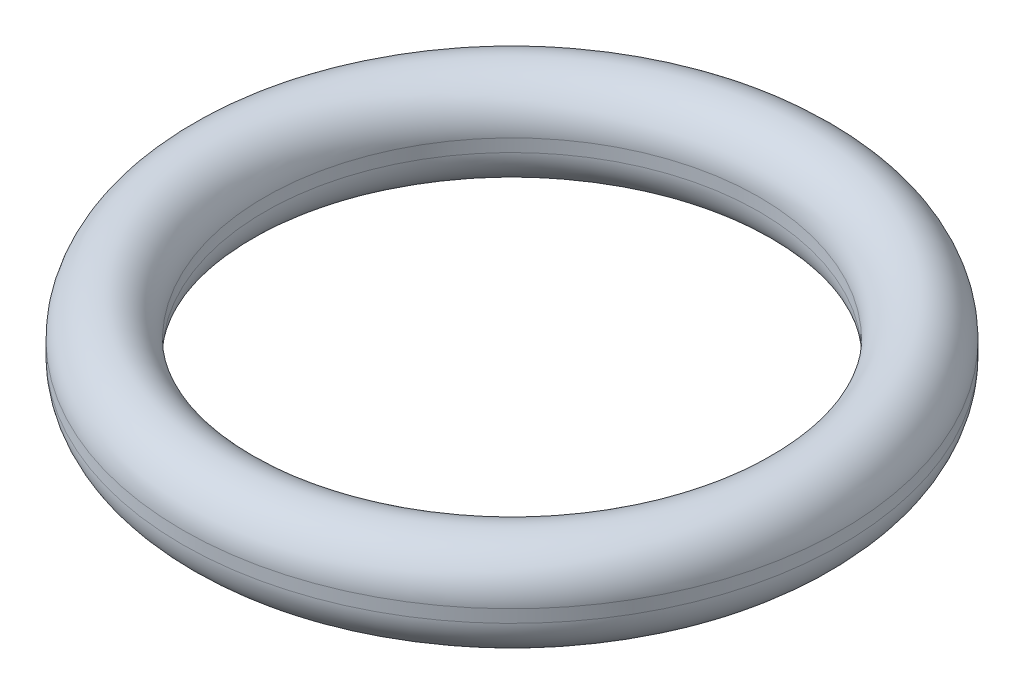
ISO-10303-21;
HEADER;
FILE_DESCRIPTION(('STEP AP214'),'2;1');
FILE_NAME('part.step','',(''),(''),'','','');
FILE_SCHEMA(('AUTOMOTIVE_DESIGN { 1 0 10303 214 1 1 1 1 }'));
ENDSEC;
DATA;
#1=APPLICATION_CONTEXT('core data for automotive mechanical design processes');
#2=APPLICATION_PROTOCOL_DEFINITION('international standard','automotive_design',2000,#1);
#3=PRODUCT_CONTEXT('',#1,'mechanical');
#4=PRODUCT('Part','Part','',(#3));
#5=PRODUCT_RELATED_PRODUCT_CATEGORY('part','',(#4));
#6=PRODUCT_DEFINITION_FORMATION('','',#4);
#7=PRODUCT_DEFINITION_CONTEXT('part definition',#1,'design');
#8=PRODUCT_DEFINITION('design','',#6,#7);
#9=PRODUCT_DEFINITION_SHAPE('','',#8);
#10=(LENGTH_UNIT() NAMED_UNIT(*) SI_UNIT(.MILLI.,.METRE.));
#11=(NAMED_UNIT(*) PLANE_ANGLE_UNIT() SI_UNIT($,.RADIAN.));
#12=(NAMED_UNIT(*) SI_UNIT($,.STERADIAN.) SOLID_ANGLE_UNIT());
#13=UNCERTAINTY_MEASURE_WITH_UNIT(LENGTH_MEASURE(1.E-05),#10,'distance_accuracy_value','');
#14=(GEOMETRIC_REPRESENTATION_CONTEXT(3) GLOBAL_UNCERTAINTY_ASSIGNED_CONTEXT((#13)) GLOBAL_UNIT_ASSIGNED_CONTEXT((#10,
#11,#12)) REPRESENTATION_CONTEXT('',''));
#15=CARTESIAN_POINT('',(0.,0.,0.));
#16=DIRECTION('',(0.,0.,1.));
#17=DIRECTION('',(1.,0.,0.));
#18=AXIS2_PLACEMENT_3D('',#15,#16,#17);
#19=CARTESIAN_POINT('',(0.,0.,0.));
#20=DIRECTION('',(0.,-1.,0.));
#21=DIRECTION('',(0.,0.,-1.));
#22=AXIS2_PLACEMENT_3D('',#19,#20,#21);
#23=TOROIDAL_SURFACE('',#22,2.88925,0.412750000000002);
#24=CARTESIAN_POINT('',(0.,0.,0.));
#25=DIRECTION('',(0.,-1.,0.));
#26=DIRECTION('',(0.,0.,-1.));
#27=AXIS2_PLACEMENT_3D('',#24,#25,#26);
#28=CIRCLE('',#27,3.302);
#29=CARTESIAN_POINT('',(0.,0.,-3.302));
#30=VERTEX_POINT('',#29);
#31=EDGE_CURVE('E44',#30,#30,#28,.T.);
#32=ORIENTED_EDGE('',*,*,#31,.T.);
#33=EDGE_LOOP('',(#32));
#34=FACE_BOUND('',#33,.T.);
#35=CARTESIAN_POINT('',(0.,0.,0.));
#36=DIRECTION('',(0.,-1.,0.));
#37=DIRECTION('',(0.,0.,-1.));
#38=AXIS2_PLACEMENT_3D('',#35,#36,#37);
#39=CIRCLE('',#38,2.4765);
#40=CARTESIAN_POINT('',(0.,0.,-2.4765));
#41=VERTEX_POINT('',#40);
#42=EDGE_CURVE('E10',#41,#41,#39,.T.);
#43=ORIENTED_EDGE('',*,*,#42,.F.);
#44=EDGE_LOOP('',(#43));
#45=FACE_BOUND('',#44,.T.);
#46=ADVANCED_FACE('F30',(#34,#45),#23,.T.);
#47=CARTESIAN_POINT('',(0.,0.,0.));
#48=DIRECTION('',(0.,-1.,0.));
#49=DIRECTION('',(0.,0.,-1.));
#50=AXIS2_PLACEMENT_3D('',#47,#48,#49);
#51=CYLINDRICAL_SURFACE('',#50,2.4765);
#52=ORIENTED_EDGE('',*,*,#42,.T.);
#53=EDGE_LOOP('',(#52));
#54=FACE_BOUND('',#53,.T.);
#55=CARTESIAN_POINT('',(0.,0.127,0.));
#56=DIRECTION('',(0.,-1.,0.));
#57=DIRECTION('',(0.,0.,-1.));
#58=AXIS2_PLACEMENT_3D('',#55,#56,#57);
#59=CIRCLE('',#58,2.4765);
#60=CARTESIAN_POINT('',(0.,0.127,-2.4765));
#61=VERTEX_POINT('',#60);
#62=EDGE_CURVE('E36',#61,#61,#59,.T.);
#63=ORIENTED_EDGE('',*,*,#62,.F.);
#64=EDGE_LOOP('',(#63));
#65=FACE_BOUND('',#64,.T.);
#66=ADVANCED_FACE('F60',(#54,#65),#51,.F.);
#67=CARTESIAN_POINT('',(0.,0.127,0.));
#68=DIRECTION('',(0.,-1.,0.));
#69=DIRECTION('',(0.,0.,-1.));
#70=AXIS2_PLACEMENT_3D('',#67,#68,#69);
#71=TOROIDAL_SURFACE('',#70,2.88925,0.41275);
#72=ORIENTED_EDGE('',*,*,#62,.T.);
#73=EDGE_LOOP('',(#72));
#74=FACE_BOUND('',#73,.T.);
#75=CARTESIAN_POINT('',(0.,0.127,0.));
#76=DIRECTION('',(0.,-1.,0.));
#77=DIRECTION('',(0.,0.,-1.));
#78=AXIS2_PLACEMENT_3D('',#75,#76,#77);
#79=CIRCLE('',#78,3.302);
#80=CARTESIAN_POINT('',(0.,0.127,-3.302));
#81=VERTEX_POINT('',#80);
#82=EDGE_CURVE('E40',#81,#81,#79,.T.);
#83=ORIENTED_EDGE('',*,*,#82,.F.);
#84=EDGE_LOOP('',(#83));
#85=FACE_BOUND('',#84,.T.);
#86=ADVANCED_FACE('F54',(#74,#85),#71,.T.);
#87=CARTESIAN_POINT('',(0.,0.,0.));
#88=DIRECTION('',(0.,-1.,0.));
#89=DIRECTION('',(0.,0.,-1.));
#90=AXIS2_PLACEMENT_3D('',#87,#88,#89);
#91=CYLINDRICAL_SURFACE('',#90,3.302);
#92=ORIENTED_EDGE('',*,*,#82,.T.);
#93=EDGE_LOOP('',(#92));
#94=FACE_BOUND('',#93,.T.);
#95=ORIENTED_EDGE('',*,*,#31,.F.);
#96=EDGE_LOOP('',(#95));
#97=FACE_BOUND('',#96,.T.);
#98=ADVANCED_FACE('F52',(#94,#97),#91,.T.);
#99=CLOSED_SHELL('',(#46,#66,#86,#98));
#100=MANIFOLD_SOLID_BREP('B2',#99);
#101=ADVANCED_BREP_SHAPE_REPRESENTATION('',(#18,#100),#14);
#102=SHAPE_DEFINITION_REPRESENTATION(#9,#101);
ENDSEC;
END-ISO-10303-21;
